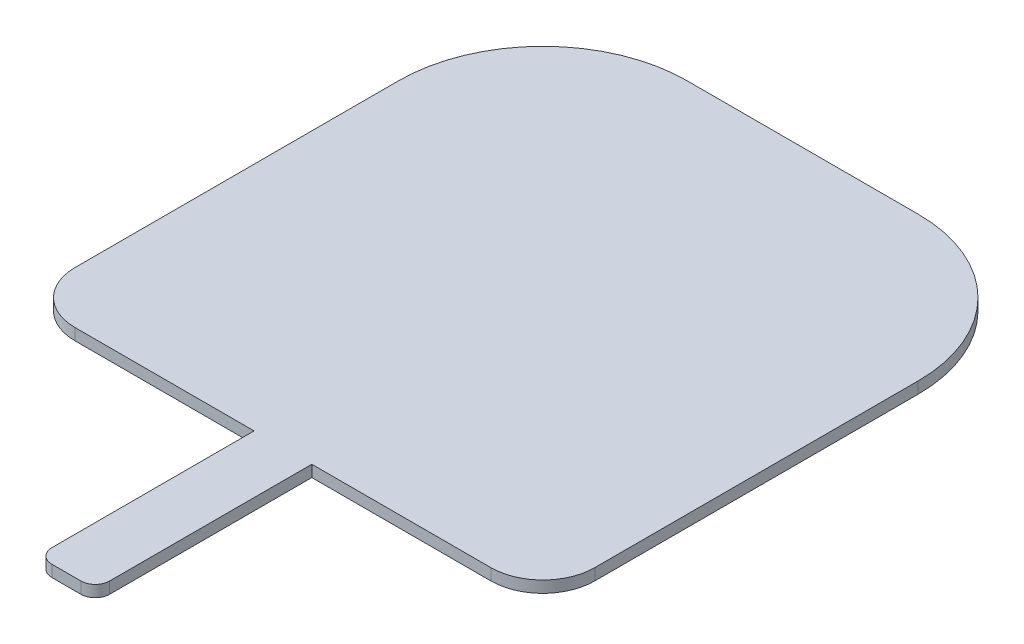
from build123d import *

# Parameters (mm, degrees)
SKETCH1_W           = 360
SKETCH1_H           = 360
BOSS_EXTRUDE1_DEPTH = 8
FILLET1_R           = 100
SKETCH2_W           = 40
SKETCH2_H           = 150
BOSS_EXTRUDE2_DEPTH = 8
FILLET2_R           = 36
FILLET3_R           = 10


with BuildPart() as part:
    # Sketch1 → Boss-Extrude1 (new body)
    with BuildSketch(Plane(origin=(0, 0, 0), x_dir=(1, 0, 0), z_dir=(0, 1, 0))):
        Rectangle(SKETCH1_W, SKETCH1_H)
    extrude(amount=BOSS_EXTRUDE1_DEPTH)

    # Fillet1
    fillet1_edges = [part.edges().sort_by_distance(p)[0] for p in [
        (-180, 4, -180),
        (180, 4, -180),
    ]]
    fillet(fillet1_edges, radius=FILLET1_R)

    # Sketch2 → Boss-Extrude2 (add)
    with BuildSketch(Plane(origin=(0, 0, 0), x_dir=(1, 0, 0), z_dir=(0, 1, 0))):
        with Locations((0, -255)):
            Rectangle(SKETCH2_W, SKETCH2_H)
    extrude(amount=BOSS_EXTRUDE2_DEPTH)

    # Fillet2
    fillet2_edges = [part.edges().sort_by_distance(p)[0] for p in [
        (180, 4, 180),
        (-180, 4, 180),
    ]]
    fillet(fillet2_edges, radius=FILLET2_R)

    # Fillet3
    fillet3_edges = [part.edges().sort_by_distance(p)[0] for p in [
        (20, 4, 330),
        (-20, 4, 330),
    ]]
    fillet(fillet3_edges, radius=FILLET3_R)


solid = part.part
